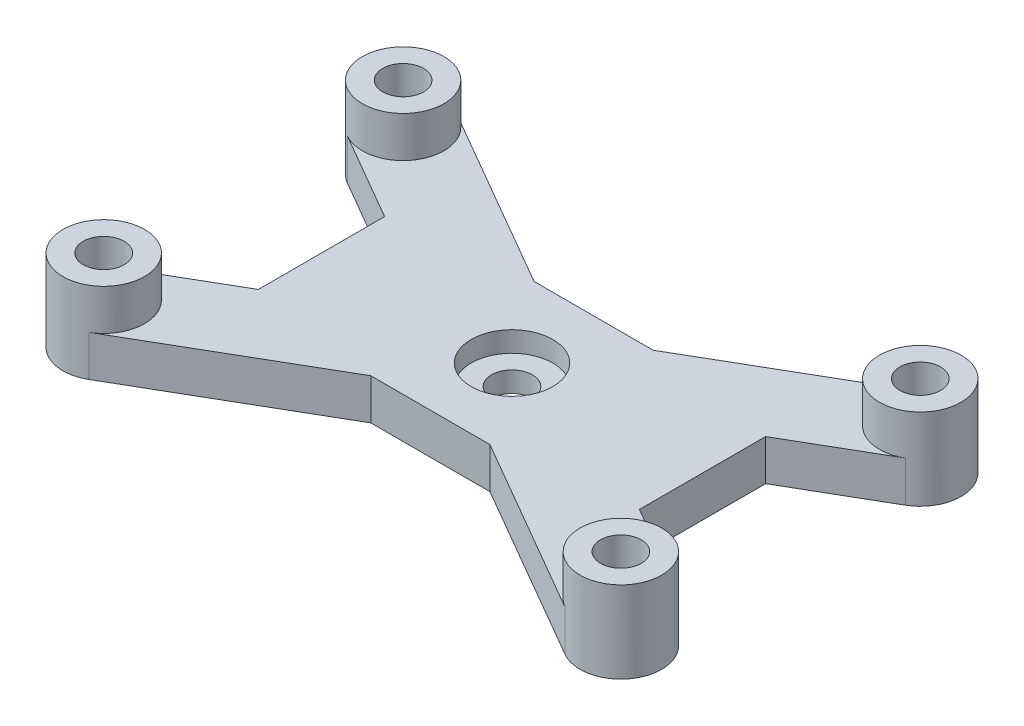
ISO-10303-21;
HEADER;
FILE_DESCRIPTION(('STEP AP214'),'2;1');
FILE_NAME('part.step','',(''),(''),'','','');
FILE_SCHEMA(('AUTOMOTIVE_DESIGN { 1 0 10303 214 1 1 1 1 }'));
ENDSEC;
DATA;
#1=APPLICATION_CONTEXT('core data for automotive mechanical design processes');
#2=APPLICATION_PROTOCOL_DEFINITION('international standard','automotive_design',2000,#1);
#3=PRODUCT_CONTEXT('',#1,'mechanical');
#4=PRODUCT('Part','Part','',(#3));
#5=PRODUCT_RELATED_PRODUCT_CATEGORY('part','',(#4));
#6=PRODUCT_DEFINITION_FORMATION('','',#4);
#7=PRODUCT_DEFINITION_CONTEXT('part definition',#1,'design');
#8=PRODUCT_DEFINITION('design','',#6,#7);
#9=PRODUCT_DEFINITION_SHAPE('','',#8);
#10=(LENGTH_UNIT() NAMED_UNIT(*) SI_UNIT(.MILLI.,.METRE.));
#11=(NAMED_UNIT(*) PLANE_ANGLE_UNIT() SI_UNIT($,.RADIAN.));
#12=(NAMED_UNIT(*) SI_UNIT($,.STERADIAN.) SOLID_ANGLE_UNIT());
#13=UNCERTAINTY_MEASURE_WITH_UNIT(LENGTH_MEASURE(1.E-05),#10,'distance_accuracy_value','');
#14=(GEOMETRIC_REPRESENTATION_CONTEXT(3) GLOBAL_UNCERTAINTY_ASSIGNED_CONTEXT((#13)) GLOBAL_UNIT_ASSIGNED_CONTEXT((#10,
#11,#12)) REPRESENTATION_CONTEXT('',''));
#15=CARTESIAN_POINT('',(0.,0.,0.));
#16=DIRECTION('',(0.,0.,1.));
#17=DIRECTION('',(1.,0.,0.));
#18=AXIS2_PLACEMENT_3D('',#15,#16,#17);
#19=CARTESIAN_POINT('',(-11.5680272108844,3.,-6.85034013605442));
#20=DIRECTION('',(0.,1.,0.));
#21=DIRECTION('',(0.,0.,1.));
#22=AXIS2_PLACEMENT_3D('',#19,#20,#21);
#23=PLANE('',#22);
#24=CARTESIAN_POINT('',(7.43197278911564,3.,4.14965986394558));
#25=DIRECTION('',(0.,1.,0.));
#26=DIRECTION('',(0.,0.,1.));
#27=AXIS2_PLACEMENT_3D('',#24,#25,#26);
#28=CIRCLE('',#27,3.);
#29=CARTESIAN_POINT('',(7.43197278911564,3.,7.14965986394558));
#30=VERTEX_POINT('',#29);
#31=EDGE_CURVE('E186',#30,#30,#28,.T.);
#32=ORIENTED_EDGE('',*,*,#31,.F.);
#33=EDGE_LOOP('',(#32));
#34=FACE_BOUND('',#33,.T.);
#35=DIRECTION('',(-0.865426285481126,0.,0.501036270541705));
#36=VECTOR('',#35,1.);
#37=CARTESIAN_POINT('',(-13.0711360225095,3.,12.5533810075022));
#38=LINE('',#37,#36);
#39=CARTESIAN_POINT('',(-6.56802721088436,3.,8.78842327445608));
#40=VERTEX_POINT('',#39);
#41=CARTESIAN_POINT('',(-13.0711360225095,3.,12.5533810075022));
#42=VERTEX_POINT('',#41);
#43=EDGE_CURVE('E211',#40,#42,#38,.T.);
#44=ORIENTED_EDGE('',*,*,#43,.T.);
#45=CARTESIAN_POINT('',(-11.5680272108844,3.,15.1496598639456));
#46=DIRECTION('',(0.,1.,0.));
#47=DIRECTION('',(0.,0.,1.));
#48=AXIS2_PLACEMENT_3D('',#45,#46,#47);
#49=CIRCLE('',#48,3.);
#50=CARTESIAN_POINT('',(-10.0649183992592,3.,17.745938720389));
#51=VERTEX_POINT('',#50);
#52=EDGE_CURVE('E325',#51,#42,#49,.T.);
#53=ORIENTED_EDGE('',*,*,#52,.F.);
#54=DIRECTION('',(0.865426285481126,0.,-0.501036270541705));
#55=VECTOR('',#54,1.);
#56=CARTESIAN_POINT('',(-10.0649183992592,3.,17.745938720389));
#57=LINE('',#56,#55);
#58=CARTESIAN_POINT('',(3.05592689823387,3.,10.1496598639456));
#59=VERTEX_POINT('',#58);
#60=EDGE_CURVE('E214',#51,#59,#57,.T.);
#61=ORIENTED_EDGE('',*,*,#60,.T.);
#62=DIRECTION('',(1.,0.,0.));
#63=VECTOR('',#62,1.);
#64=CARTESIAN_POINT('',(3.05592689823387,3.,10.1496598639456));
#65=LINE('',#64,#63);
#66=CARTESIAN_POINT('',(11.8080186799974,3.,10.1496598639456));
#67=VERTEX_POINT('',#66);
#68=EDGE_CURVE('E216',#59,#67,#65,.T.);
#69=ORIENTED_EDGE('',*,*,#68,.T.);
#70=DIRECTION('',(0.865426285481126,0.,0.501036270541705));
#71=VECTOR('',#70,1.);
#72=CARTESIAN_POINT('',(11.8080186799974,3.,10.1496598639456));
#73=LINE('',#72,#71);
#74=CARTESIAN_POINT('',(24.9288639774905,3.,17.745938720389));
#75=VERTEX_POINT('',#74);
#76=EDGE_CURVE('E218',#67,#75,#73,.T.);
#77=ORIENTED_EDGE('',*,*,#76,.T.);
#78=CARTESIAN_POINT('',(26.4319727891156,3.,15.1496598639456));
#79=DIRECTION('',(0.,1.,0.));
#80=DIRECTION('',(0.,0.,1.));
#81=AXIS2_PLACEMENT_3D('',#78,#79,#80);
#82=CIRCLE('',#81,3.);
#83=CARTESIAN_POINT('',(27.9350816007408,3.,12.5533810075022));
#84=VERTEX_POINT('',#83);
#85=EDGE_CURVE('E343',#84,#75,#82,.T.);
#86=ORIENTED_EDGE('',*,*,#85,.F.);
#87=DIRECTION('',(-0.865426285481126,0.,-0.501036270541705));
#88=VECTOR('',#87,1.);
#89=CARTESIAN_POINT('',(21.4319727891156,3.,8.78842327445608));
#90=LINE('',#89,#88);
#91=CARTESIAN_POINT('',(21.4319727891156,3.,8.78842327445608));
#92=VERTEX_POINT('',#91);
#93=EDGE_CURVE('E220',#84,#92,#90,.T.);
#94=ORIENTED_EDGE('',*,*,#93,.T.);
#95=DIRECTION('',(0.,0.,-1.));
#96=VECTOR('',#95,1.);
#97=CARTESIAN_POINT('',(21.4319727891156,3.,-0.489103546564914));
#98=LINE('',#97,#96);
#99=CARTESIAN_POINT('',(21.4319727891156,3.,-0.489103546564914));
#100=VERTEX_POINT('',#99);
#101=EDGE_CURVE('E151',#92,#100,#98,.T.);
#102=ORIENTED_EDGE('',*,*,#101,.T.);
#103=DIRECTION('',(0.865426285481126,0.,-0.501036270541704));
#104=VECTOR('',#103,1.);
#105=CARTESIAN_POINT('',(21.4319727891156,3.,-0.489103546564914));
#106=LINE('',#105,#104);
#107=CARTESIAN_POINT('',(27.9350816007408,3.,-4.25406127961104));
#108=VERTEX_POINT('',#107);
#109=EDGE_CURVE('E145',#100,#108,#106,.T.);
#110=ORIENTED_EDGE('',*,*,#109,.T.);
#111=CARTESIAN_POINT('',(26.4319727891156,3.,-6.85034013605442));
#112=DIRECTION('',(0.,1.,0.));
#113=DIRECTION('',(0.,0.,1.));
#114=AXIS2_PLACEMENT_3D('',#111,#112,#113);
#115=CIRCLE('',#114,3.);
#116=CARTESIAN_POINT('',(24.9288639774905,3.,-9.4466189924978));
#117=VERTEX_POINT('',#116);
#118=EDGE_CURVE('E149',#117,#108,#115,.T.);
#119=ORIENTED_EDGE('',*,*,#118,.F.);
#120=DIRECTION('',(-0.865426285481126,0.,0.501036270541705));
#121=VECTOR('',#120,1.);
#122=CARTESIAN_POINT('',(11.8080186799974,3.,-1.85034013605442));
#123=LINE('',#122,#121);
#124=CARTESIAN_POINT('',(11.8080186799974,3.,-1.85034013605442));
#125=VERTEX_POINT('',#124);
#126=EDGE_CURVE('E155',#117,#125,#123,.T.);
#127=ORIENTED_EDGE('',*,*,#126,.T.);
#128=DIRECTION('',(-1.,0.,0.));
#129=VECTOR('',#128,1.);
#130=CARTESIAN_POINT('',(3.05592689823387,3.,-1.85034013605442));
#131=LINE('',#130,#129);
#132=CARTESIAN_POINT('',(3.05592689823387,3.,-1.85034013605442));
#133=VERTEX_POINT('',#132);
#134=EDGE_CURVE('E51',#125,#133,#131,.T.);
#135=ORIENTED_EDGE('',*,*,#134,.T.);
#136=DIRECTION('',(-0.865426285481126,0.,-0.501036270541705));
#137=VECTOR('',#136,1.);
#138=CARTESIAN_POINT('',(-10.0649183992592,3.,-9.4466189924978));
#139=LINE('',#138,#137);
#140=CARTESIAN_POINT('',(-10.0649183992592,3.,-9.4466189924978));
#141=VERTEX_POINT('',#140);
#142=EDGE_CURVE('E225',#133,#141,#139,.T.);
#143=ORIENTED_EDGE('',*,*,#142,.T.);
#144=CARTESIAN_POINT('',(-11.5680272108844,3.,-6.85034013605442));
#145=DIRECTION('',(0.,1.,0.));
#146=DIRECTION('',(0.,0.,1.));
#147=AXIS2_PLACEMENT_3D('',#144,#145,#146);
#148=CIRCLE('',#147,3.);
#149=CARTESIAN_POINT('',(-13.0711360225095,3.,-4.25406127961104));
#150=VERTEX_POINT('',#149);
#151=EDGE_CURVE('E11',#150,#141,#148,.T.);
#152=ORIENTED_EDGE('',*,*,#151,.F.);
#153=DIRECTION('',(0.865426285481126,0.,0.501036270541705));
#154=VECTOR('',#153,1.);
#155=CARTESIAN_POINT('',(-13.0711360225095,3.,-4.25406127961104));
#156=LINE('',#155,#154);
#157=CARTESIAN_POINT('',(-6.56802721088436,3.,-0.489103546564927));
#158=VERTEX_POINT('',#157);
#159=EDGE_CURVE('E212',#150,#158,#156,.T.);
#160=ORIENTED_EDGE('',*,*,#159,.T.);
#161=DIRECTION('',(0.,0.,1.));
#162=VECTOR('',#161,1.);
#163=CARTESIAN_POINT('',(-6.56802721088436,3.,-0.489103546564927));
#164=LINE('',#163,#162);
#165=EDGE_CURVE('E209',#158,#40,#164,.T.);
#166=ORIENTED_EDGE('',*,*,#165,.T.);
#167=EDGE_LOOP('',(#44,#53,#61,#69,#77,#86,#94,#102,#110,#119,#127,#135,#143,#152,#160,#166));
#168=FACE_BOUND('',#167,.T.);
#169=ADVANCED_FACE('F32',(#34,#168),#23,.T.);
#170=CARTESIAN_POINT('',(7.43197278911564,3.,4.14965986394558));
#171=DIRECTION('',(0.,-1.,0.));
#172=DIRECTION('',(0.,0.,-1.));
#173=AXIS2_PLACEMENT_3D('',#170,#171,#172);
#174=CYLINDRICAL_SURFACE('',#173,1.5);
#175=CARTESIAN_POINT('',(7.43197278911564,0.,4.14965986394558));
#176=DIRECTION('',(0.,1.,0.));
#177=DIRECTION('',(0.,0.,1.));
#178=AXIS2_PLACEMENT_3D('',#175,#176,#177);
#179=CIRCLE('',#178,1.5);
#180=CARTESIAN_POINT('',(7.43197278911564,0.,5.64965986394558));
#181=VERTEX_POINT('',#180);
#182=EDGE_CURVE('E193',#181,#181,#179,.T.);
#183=ORIENTED_EDGE('',*,*,#182,.F.);
#184=EDGE_LOOP('',(#183));
#185=FACE_BOUND('',#184,.T.);
#186=CARTESIAN_POINT('',(7.43197278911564,1.5,4.14965986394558));
#187=DIRECTION('',(0.,1.,0.));
#188=DIRECTION('',(0.,0.,1.));
#189=AXIS2_PLACEMENT_3D('',#186,#187,#188);
#190=CIRCLE('',#189,1.5);
#191=CARTESIAN_POINT('',(7.43197278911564,1.5,5.64965986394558));
#192=VERTEX_POINT('',#191);
#193=EDGE_CURVE('E190',#192,#192,#190,.T.);
#194=ORIENTED_EDGE('',*,*,#193,.T.);
#195=EDGE_LOOP('',(#194));
#196=FACE_BOUND('',#195,.T.);
#197=ADVANCED_FACE('F377',(#185,#196),#174,.F.);
#198=CARTESIAN_POINT('',(-11.5680272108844,0.,-6.85034013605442));
#199=DIRECTION('',(0.,1.,0.));
#200=DIRECTION('',(0.,0.,1.));
#201=AXIS2_PLACEMENT_3D('',#198,#199,#200);
#202=PLANE('',#201);
#203=CARTESIAN_POINT('',(26.4319727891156,0.,15.1496598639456));
#204=DIRECTION('',(0.,1.,0.));
#205=DIRECTION('',(0.,0.,1.));
#206=AXIS2_PLACEMENT_3D('',#203,#204,#205);
#207=CIRCLE('',#206,1.5);
#208=CARTESIAN_POINT('',(26.4319727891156,0.,16.6496598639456));
#209=VERTEX_POINT('',#208);
#210=EDGE_CURVE('E196',#209,#209,#207,.T.);
#211=ORIENTED_EDGE('',*,*,#210,.T.);
#212=EDGE_LOOP('',(#211));
#213=FACE_BOUND('',#212,.T.);
#214=CARTESIAN_POINT('',(26.4319727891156,0.,-6.85034013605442));
#215=DIRECTION('',(0.,1.,0.));
#216=DIRECTION('',(0.,0.,1.));
#217=AXIS2_PLACEMENT_3D('',#214,#215,#216);
#218=CIRCLE('',#217,1.5);
#219=CARTESIAN_POINT('',(26.4319727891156,0.,-5.35034013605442));
#220=VERTEX_POINT('',#219);
#221=EDGE_CURVE('E202',#220,#220,#218,.T.);
#222=ORIENTED_EDGE('',*,*,#221,.T.);
#223=EDGE_LOOP('',(#222));
#224=FACE_BOUND('',#223,.T.);
#225=CARTESIAN_POINT('',(-11.5680272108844,0.,-6.85034013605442));
#226=DIRECTION('',(0.,1.,0.));
#227=DIRECTION('',(0.,0.,1.));
#228=AXIS2_PLACEMENT_3D('',#225,#226,#227);
#229=CIRCLE('',#228,3.);
#230=CARTESIAN_POINT('',(-10.0649183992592,0.,-9.4466189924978));
#231=VERTEX_POINT('',#230);
#232=CARTESIAN_POINT('',(-13.0711360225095,0.,-4.25406127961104));
#233=VERTEX_POINT('',#232);
#234=EDGE_CURVE('E208',#231,#233,#229,.T.);
#235=ORIENTED_EDGE('',*,*,#234,.F.);
#236=DIRECTION('',(-0.865426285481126,0.,-0.501036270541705));
#237=VECTOR('',#236,1.);
#238=CARTESIAN_POINT('',(-10.0649183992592,0.,-9.4466189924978));
#239=LINE('',#238,#237);
#240=CARTESIAN_POINT('',(3.05592689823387,0.,-1.85034013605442));
#241=VERTEX_POINT('',#240);
#242=EDGE_CURVE('E111',#241,#231,#239,.T.);
#243=ORIENTED_EDGE('',*,*,#242,.F.);
#244=DIRECTION('',(-1.,0.,0.));
#245=VECTOR('',#244,1.);
#246=CARTESIAN_POINT('',(3.05592689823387,0.,-1.85034013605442));
#247=LINE('',#246,#245);
#248=CARTESIAN_POINT('',(11.8080186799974,0.,-1.85034013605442));
#249=VERTEX_POINT('',#248);
#250=EDGE_CURVE('E104',#249,#241,#247,.T.);
#251=ORIENTED_EDGE('',*,*,#250,.F.);
#252=DIRECTION('',(-0.865426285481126,0.,0.501036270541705));
#253=VECTOR('',#252,1.);
#254=CARTESIAN_POINT('',(11.8080186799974,0.,-1.85034013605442));
#255=LINE('',#254,#253);
#256=CARTESIAN_POINT('',(24.9288639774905,0.,-9.4466189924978));
#257=VERTEX_POINT('',#256);
#258=EDGE_CURVE('E251',#257,#249,#255,.T.);
#259=ORIENTED_EDGE('',*,*,#258,.F.);
#260=CARTESIAN_POINT('',(26.4319727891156,0.,-6.85034013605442));
#261=DIRECTION('',(0.,1.,0.));
#262=DIRECTION('',(0.,0.,1.));
#263=AXIS2_PLACEMENT_3D('',#260,#261,#262);
#264=CIRCLE('',#263,3.);
#265=CARTESIAN_POINT('',(27.9350816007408,0.,-4.25406127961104));
#266=VERTEX_POINT('',#265);
#267=EDGE_CURVE('E249',#266,#257,#264,.T.);
#268=ORIENTED_EDGE('',*,*,#267,.F.);
#269=DIRECTION('',(0.865426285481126,0.,-0.501036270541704));
#270=VECTOR('',#269,1.);
#271=CARTESIAN_POINT('',(21.4319727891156,0.,-0.489103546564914));
#272=LINE('',#271,#270);
#273=CARTESIAN_POINT('',(21.4319727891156,0.,-0.489103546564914));
#274=VERTEX_POINT('',#273);
#275=EDGE_CURVE('E161',#274,#266,#272,.T.);
#276=ORIENTED_EDGE('',*,*,#275,.F.);
#277=DIRECTION('',(0.,0.,-1.));
#278=VECTOR('',#277,1.);
#279=CARTESIAN_POINT('',(21.4319727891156,0.,-0.489103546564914));
#280=LINE('',#279,#278);
#281=CARTESIAN_POINT('',(21.4319727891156,0.,8.78842327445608));
#282=VERTEX_POINT('',#281);
#283=EDGE_CURVE('E246',#282,#274,#280,.T.);
#284=ORIENTED_EDGE('',*,*,#283,.F.);
#285=DIRECTION('',(-0.865426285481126,0.,-0.501036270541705));
#286=VECTOR('',#285,1.);
#287=CARTESIAN_POINT('',(21.4319727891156,0.,8.78842327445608));
#288=LINE('',#287,#286);
#289=CARTESIAN_POINT('',(27.9350816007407,0.,12.5533810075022));
#290=VERTEX_POINT('',#289);
#291=EDGE_CURVE('E244',#290,#282,#288,.T.);
#292=ORIENTED_EDGE('',*,*,#291,.F.);
#293=CARTESIAN_POINT('',(26.4319727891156,0.,15.1496598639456));
#294=DIRECTION('',(0.,1.,0.));
#295=DIRECTION('',(0.,0.,1.));
#296=AXIS2_PLACEMENT_3D('',#293,#294,#295);
#297=CIRCLE('',#296,3.);
#298=CARTESIAN_POINT('',(24.9288639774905,0.,17.745938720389));
#299=VERTEX_POINT('',#298);
#300=EDGE_CURVE('E242',#299,#290,#297,.T.);
#301=ORIENTED_EDGE('',*,*,#300,.F.);
#302=DIRECTION('',(0.865426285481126,0.,0.501036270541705));
#303=VECTOR('',#302,1.);
#304=CARTESIAN_POINT('',(11.8080186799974,0.,10.1496598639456));
#305=LINE('',#304,#303);
#306=CARTESIAN_POINT('',(11.8080186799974,0.,10.1496598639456));
#307=VERTEX_POINT('',#306);
#308=EDGE_CURVE('E240',#307,#299,#305,.T.);
#309=ORIENTED_EDGE('',*,*,#308,.F.);
#310=DIRECTION('',(1.,0.,0.));
#311=VECTOR('',#310,1.);
#312=CARTESIAN_POINT('',(3.05592689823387,0.,10.1496598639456));
#313=LINE('',#312,#311);
#314=CARTESIAN_POINT('',(3.05592689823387,0.,10.1496598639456));
#315=VERTEX_POINT('',#314);
#316=EDGE_CURVE('E238',#315,#307,#313,.T.);
#317=ORIENTED_EDGE('',*,*,#316,.F.);
#318=DIRECTION('',(0.865426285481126,0.,-0.501036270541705));
#319=VECTOR('',#318,1.);
#320=CARTESIAN_POINT('',(-10.0649183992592,0.,17.745938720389));
#321=LINE('',#320,#319);
#322=CARTESIAN_POINT('',(-10.0649183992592,0.,17.745938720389));
#323=VERTEX_POINT('',#322);
#324=EDGE_CURVE('E236',#323,#315,#321,.T.);
#325=ORIENTED_EDGE('',*,*,#324,.F.);
#326=CARTESIAN_POINT('',(-11.5680272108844,0.,15.1496598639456));
#327=DIRECTION('',(0.,1.,0.));
#328=DIRECTION('',(0.,0.,1.));
#329=AXIS2_PLACEMENT_3D('',#326,#327,#328);
#330=CIRCLE('',#329,3.);
#331=CARTESIAN_POINT('',(-13.0711360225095,0.,12.5533810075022));
#332=VERTEX_POINT('',#331);
#333=EDGE_CURVE('E234',#332,#323,#330,.T.);
#334=ORIENTED_EDGE('',*,*,#333,.F.);
#335=DIRECTION('',(-0.865426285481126,0.,0.501036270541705));
#336=VECTOR('',#335,1.);
#337=CARTESIAN_POINT('',(-13.0711360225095,0.,12.5533810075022));
#338=LINE('',#337,#336);
#339=CARTESIAN_POINT('',(-6.56802721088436,0.,8.78842327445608));
#340=VERTEX_POINT('',#339);
#341=EDGE_CURVE('E232',#340,#332,#338,.T.);
#342=ORIENTED_EDGE('',*,*,#341,.F.);
#343=DIRECTION('',(0.,0.,1.));
#344=VECTOR('',#343,1.);
#345=CARTESIAN_POINT('',(-6.56802721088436,0.,-0.489103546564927));
#346=LINE('',#345,#344);
#347=CARTESIAN_POINT('',(-6.56802721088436,0.,-0.489103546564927));
#348=VERTEX_POINT('',#347);
#349=EDGE_CURVE('E230',#348,#340,#346,.T.);
#350=ORIENTED_EDGE('',*,*,#349,.F.);
#351=DIRECTION('',(0.865426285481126,0.,0.501036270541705));
#352=VECTOR('',#351,1.);
#353=CARTESIAN_POINT('',(-13.0711360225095,0.,-4.25406127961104));
#354=LINE('',#353,#352);
#355=EDGE_CURVE('E228',#233,#348,#354,.T.);
#356=ORIENTED_EDGE('',*,*,#355,.F.);
#357=EDGE_LOOP('',(#235,#243,#251,#259,#268,#276,#284,#292,#301,#309,#317,#325,#334,#342,#350,#356));
#358=FACE_BOUND('',#357,.T.);
#359=CARTESIAN_POINT('',(-11.5680272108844,0.,-6.85034013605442));
#360=DIRECTION('',(0.,1.,0.));
#361=DIRECTION('',(0.,0.,1.));
#362=AXIS2_PLACEMENT_3D('',#359,#360,#361);
#363=CIRCLE('',#362,1.5);
#364=CARTESIAN_POINT('',(-11.5680272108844,0.,-5.35034013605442));
#365=VERTEX_POINT('',#364);
#366=EDGE_CURVE('E205',#365,#365,#363,.T.);
#367=ORIENTED_EDGE('',*,*,#366,.T.);
#368=EDGE_LOOP('',(#367));
#369=FACE_BOUND('',#368,.T.);
#370=CARTESIAN_POINT('',(-11.5680272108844,0.,15.1496598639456));
#371=DIRECTION('',(0.,1.,0.));
#372=DIRECTION('',(0.,0.,1.));
#373=AXIS2_PLACEMENT_3D('',#370,#371,#372);
#374=CIRCLE('',#373,1.5);
#375=CARTESIAN_POINT('',(-11.5680272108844,0.,16.6496598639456));
#376=VERTEX_POINT('',#375);
#377=EDGE_CURVE('E199',#376,#376,#374,.T.);
#378=ORIENTED_EDGE('',*,*,#377,.T.);
#379=EDGE_LOOP('',(#378));
#380=FACE_BOUND('',#379,.T.);
#381=ORIENTED_EDGE('',*,*,#182,.T.);
#382=EDGE_LOOP('',(#381));
#383=FACE_BOUND('',#382,.T.);
#384=ADVANCED_FACE('F309',(#213,#224,#358,#369,#380,#383),#202,.F.);
#385=CARTESIAN_POINT('',(-11.5680272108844,3.,-6.85034013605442));
#386=DIRECTION('',(0.,-1.,0.));
#387=DIRECTION('',(0.,0.,-1.));
#388=AXIS2_PLACEMENT_3D('',#385,#386,#387);
#389=CYLINDRICAL_SURFACE('',#388,3.);
#390=ORIENTED_EDGE('',*,*,#234,.T.);
#391=DIRECTION('',(0.,-1.,0.));
#392=VECTOR('',#391,1.);
#393=CARTESIAN_POINT('',(-13.0711360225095,3.,-4.25406127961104));
#394=LINE('',#393,#392);
#395=EDGE_CURVE('E42',#150,#233,#394,.T.);
#396=ORIENTED_EDGE('',*,*,#395,.F.);
#397=ORIENTED_EDGE('',*,*,#151,.T.);
#398=DIRECTION('',(0.,-1.,0.));
#399=VECTOR('',#398,1.);
#400=CARTESIAN_POINT('',(-10.0649183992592,3.,-9.4466189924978));
#401=LINE('',#400,#399);
#402=EDGE_CURVE('E258',#141,#231,#401,.T.);
#403=ORIENTED_EDGE('',*,*,#402,.T.);
#404=EDGE_LOOP('',(#390,#396,#397,#403));
#405=FACE_BOUND('',#404,.T.);
#406=CARTESIAN_POINT('',(-11.5680272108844,6.,-6.85034013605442));
#407=DIRECTION('',(0.,1.,0.));
#408=DIRECTION('',(0.,0.,1.));
#409=AXIS2_PLACEMENT_3D('',#406,#407,#408);
#410=CIRCLE('',#409,3.);
#411=CARTESIAN_POINT('',(-11.5680272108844,6.,-3.85034013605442));
#412=VERTEX_POINT('',#411);
#413=EDGE_CURVE('E183',#412,#412,#410,.T.);
#414=ORIENTED_EDGE('',*,*,#413,.F.);
#415=EDGE_LOOP('',(#414));
#416=FACE_BOUND('',#415,.T.);
#417=ADVANCED_FACE('F34',(#405,#416),#389,.T.);
#418=CARTESIAN_POINT('',(-13.0711360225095,3.,-4.25406127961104));
#419=DIRECTION('',(0.501036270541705,0.,-0.865426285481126));
#420=DIRECTION('',(-0.865426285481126,0.,-0.501036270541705));
#421=AXIS2_PLACEMENT_3D('',#418,#419,#420);
#422=PLANE('',#421);
#423=ORIENTED_EDGE('',*,*,#355,.T.);
#424=DIRECTION('',(0.,-1.,0.));
#425=VECTOR('',#424,1.);
#426=CARTESIAN_POINT('',(-6.56802721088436,3.,-0.489103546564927));
#427=LINE('',#426,#425);
#428=EDGE_CURVE('E286',#158,#348,#427,.T.);
#429=ORIENTED_EDGE('',*,*,#428,.F.);
#430=ORIENTED_EDGE('',*,*,#159,.F.);
#431=ORIENTED_EDGE('',*,*,#395,.T.);
#432=EDGE_LOOP('',(#423,#429,#430,#431));
#433=FACE_BOUND('',#432,.T.);
#434=ADVANCED_FACE('F303',(#433),#422,.F.);
#435=CARTESIAN_POINT('',(-6.56802721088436,3.,-0.489103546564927));
#436=DIRECTION('',(1.,0.,0.));
#437=DIRECTION('',(0.,0.,-1.));
#438=AXIS2_PLACEMENT_3D('',#435,#436,#437);
#439=PLANE('',#438);
#440=ORIENTED_EDGE('',*,*,#349,.T.);
#441=DIRECTION('',(0.,-1.,0.));
#442=VECTOR('',#441,1.);
#443=CARTESIAN_POINT('',(-6.56802721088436,3.,8.78842327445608));
#444=LINE('',#443,#442);
#445=EDGE_CURVE('E283',#40,#340,#444,.T.);
#446=ORIENTED_EDGE('',*,*,#445,.F.);
#447=ORIENTED_EDGE('',*,*,#165,.F.);
#448=ORIENTED_EDGE('',*,*,#428,.T.);
#449=EDGE_LOOP('',(#440,#446,#447,#448));
#450=FACE_BOUND('',#449,.T.);
#451=ADVANCED_FACE('F316',(#450),#439,.F.);
#452=CARTESIAN_POINT('',(-13.0711360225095,3.,12.5533810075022));
#453=DIRECTION('',(0.501036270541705,0.,0.865426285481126));
#454=DIRECTION('',(0.865426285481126,0.,-0.501036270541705));
#455=AXIS2_PLACEMENT_3D('',#452,#453,#454);
#456=PLANE('',#455);
#457=ORIENTED_EDGE('',*,*,#341,.T.);
#458=DIRECTION('',(0.,-1.,0.));
#459=VECTOR('',#458,1.);
#460=CARTESIAN_POINT('',(-13.0711360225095,3.,12.5533810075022));
#461=LINE('',#460,#459);
#462=EDGE_CURVE('E280',#42,#332,#461,.T.);
#463=ORIENTED_EDGE('',*,*,#462,.F.);
#464=ORIENTED_EDGE('',*,*,#43,.F.);
#465=ORIENTED_EDGE('',*,*,#445,.T.);
#466=EDGE_LOOP('',(#457,#463,#464,#465));
#467=FACE_BOUND('',#466,.T.);
#468=ADVANCED_FACE('F320',(#467),#456,.F.);
#469=CARTESIAN_POINT('',(-11.5680272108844,3.,15.1496598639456));
#470=DIRECTION('',(0.,-1.,0.));
#471=DIRECTION('',(0.,0.,-1.));
#472=AXIS2_PLACEMENT_3D('',#469,#470,#471);
#473=CYLINDRICAL_SURFACE('',#472,3.);
#474=ORIENTED_EDGE('',*,*,#333,.T.);
#475=DIRECTION('',(0.,-1.,0.));
#476=VECTOR('',#475,1.);
#477=CARTESIAN_POINT('',(-10.0649183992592,3.,17.745938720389));
#478=LINE('',#477,#476);
#479=EDGE_CURVE('E277',#51,#323,#478,.T.);
#480=ORIENTED_EDGE('',*,*,#479,.F.);
#481=ORIENTED_EDGE('',*,*,#52,.T.);
#482=ORIENTED_EDGE('',*,*,#462,.T.);
#483=EDGE_LOOP('',(#474,#480,#481,#482));
#484=FACE_BOUND('',#483,.T.);
#485=CARTESIAN_POINT('',(-11.5680272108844,6.,15.1496598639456));
#486=DIRECTION('',(0.,1.,0.));
#487=DIRECTION('',(0.,0.,1.));
#488=AXIS2_PLACEMENT_3D('',#485,#486,#487);
#489=CIRCLE('',#488,3.);
#490=CARTESIAN_POINT('',(-11.5680272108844,6.,18.1496598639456));
#491=VERTEX_POINT('',#490);
#492=EDGE_CURVE('E332',#491,#491,#489,.T.);
#493=ORIENTED_EDGE('',*,*,#492,.F.);
#494=EDGE_LOOP('',(#493));
#495=FACE_BOUND('',#494,.T.);
#496=ADVANCED_FACE('F451',(#484,#495),#473,.T.);
#497=CARTESIAN_POINT('',(-10.0649183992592,3.,17.745938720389));
#498=DIRECTION('',(-0.501036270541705,0.,-0.865426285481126));
#499=DIRECTION('',(-0.865426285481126,0.,0.501036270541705));
#500=AXIS2_PLACEMENT_3D('',#497,#498,#499);
#501=PLANE('',#500);
#502=ORIENTED_EDGE('',*,*,#324,.T.);
#503=DIRECTION('',(0.,-1.,0.));
#504=VECTOR('',#503,1.);
#505=CARTESIAN_POINT('',(3.05592689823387,3.,10.1496598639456));
#506=LINE('',#505,#504);
#507=EDGE_CURVE('E274',#59,#315,#506,.T.);
#508=ORIENTED_EDGE('',*,*,#507,.F.);
#509=ORIENTED_EDGE('',*,*,#60,.F.);
#510=ORIENTED_EDGE('',*,*,#479,.T.);
#511=EDGE_LOOP('',(#502,#508,#509,#510));
#512=FACE_BOUND('',#511,.T.);
#513=ADVANCED_FACE('F453',(#512),#501,.F.);
#514=CARTESIAN_POINT('',(3.05592689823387,3.,10.1496598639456));
#515=DIRECTION('',(0.,0.,-1.));
#516=DIRECTION('',(-1.,0.,0.));
#517=AXIS2_PLACEMENT_3D('',#514,#515,#516);
#518=PLANE('',#517);
#519=ORIENTED_EDGE('',*,*,#316,.T.);
#520=DIRECTION('',(0.,-1.,0.));
#521=VECTOR('',#520,1.);
#522=CARTESIAN_POINT('',(11.8080186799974,3.,10.1496598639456));
#523=LINE('',#522,#521);
#524=EDGE_CURVE('E271',#67,#307,#523,.T.);
#525=ORIENTED_EDGE('',*,*,#524,.F.);
#526=ORIENTED_EDGE('',*,*,#68,.F.);
#527=ORIENTED_EDGE('',*,*,#507,.T.);
#528=EDGE_LOOP('',(#519,#525,#526,#527));
#529=FACE_BOUND('',#528,.T.);
#530=ADVANCED_FACE('F459',(#529),#518,.F.);
#531=CARTESIAN_POINT('',(11.8080186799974,3.,10.1496598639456));
#532=DIRECTION('',(0.501036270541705,0.,-0.865426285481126));
#533=DIRECTION('',(-0.865426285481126,0.,-0.501036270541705));
#534=AXIS2_PLACEMENT_3D('',#531,#532,#533);
#535=PLANE('',#534);
#536=ORIENTED_EDGE('',*,*,#308,.T.);
#537=DIRECTION('',(0.,-1.,0.));
#538=VECTOR('',#537,1.);
#539=CARTESIAN_POINT('',(24.9288639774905,3.,17.745938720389));
#540=LINE('',#539,#538);
#541=EDGE_CURVE('E268',#75,#299,#540,.T.);
#542=ORIENTED_EDGE('',*,*,#541,.F.);
#543=ORIENTED_EDGE('',*,*,#76,.F.);
#544=ORIENTED_EDGE('',*,*,#524,.T.);
#545=EDGE_LOOP('',(#536,#542,#543,#544));
#546=FACE_BOUND('',#545,.T.);
#547=ADVANCED_FACE('F530',(#546),#535,.F.);
#548=CARTESIAN_POINT('',(26.4319727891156,3.,15.1496598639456));
#549=DIRECTION('',(0.,-1.,0.));
#550=DIRECTION('',(0.,0.,-1.));
#551=AXIS2_PLACEMENT_3D('',#548,#549,#550);
#552=CYLINDRICAL_SURFACE('',#551,3.);
#553=ORIENTED_EDGE('',*,*,#300,.T.);
#554=DIRECTION('',(0.,-1.,0.));
#555=VECTOR('',#554,1.);
#556=CARTESIAN_POINT('',(27.9350816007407,3.,12.5533810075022));
#557=LINE('',#556,#555);
#558=EDGE_CURVE('E265',#84,#290,#557,.T.);
#559=ORIENTED_EDGE('',*,*,#558,.F.);
#560=ORIENTED_EDGE('',*,*,#85,.T.);
#561=ORIENTED_EDGE('',*,*,#541,.T.);
#562=EDGE_LOOP('',(#553,#559,#560,#561));
#563=FACE_BOUND('',#562,.T.);
#564=CARTESIAN_POINT('',(26.4319727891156,6.,15.1496598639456));
#565=DIRECTION('',(0.,1.,0.));
#566=DIRECTION('',(0.,0.,1.));
#567=AXIS2_PLACEMENT_3D('',#564,#565,#566);
#568=CIRCLE('',#567,3.);
#569=CARTESIAN_POINT('',(26.4319727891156,6.,18.1496598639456));
#570=VERTEX_POINT('',#569);
#571=EDGE_CURVE('E178',#570,#570,#568,.T.);
#572=ORIENTED_EDGE('',*,*,#571,.F.);
#573=EDGE_LOOP('',(#572));
#574=FACE_BOUND('',#573,.T.);
#575=ADVANCED_FACE('F350',(#563,#574),#552,.T.);
#576=CARTESIAN_POINT('',(21.4319727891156,3.,8.78842327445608));
#577=DIRECTION('',(-0.501036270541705,0.,0.865426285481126));
#578=DIRECTION('',(0.865426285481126,0.,0.501036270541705));
#579=AXIS2_PLACEMENT_3D('',#576,#577,#578);
#580=PLANE('',#579);
#581=ORIENTED_EDGE('',*,*,#291,.T.);
#582=DIRECTION('',(0.,-1.,0.));
#583=VECTOR('',#582,1.);
#584=CARTESIAN_POINT('',(21.4319727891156,3.,8.78842327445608));
#585=LINE('',#584,#583);
#586=EDGE_CURVE('E262',#92,#282,#585,.T.);
#587=ORIENTED_EDGE('',*,*,#586,.F.);
#588=ORIENTED_EDGE('',*,*,#93,.F.);
#589=ORIENTED_EDGE('',*,*,#558,.T.);
#590=EDGE_LOOP('',(#581,#587,#588,#589));
#591=FACE_BOUND('',#590,.T.);
#592=ADVANCED_FACE('F529',(#591),#580,.F.);
#593=CARTESIAN_POINT('',(21.4319727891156,3.,-0.489103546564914));
#594=DIRECTION('',(-1.,0.,0.));
#595=DIRECTION('',(0.,0.,1.));
#596=AXIS2_PLACEMENT_3D('',#593,#594,#595);
#597=PLANE('',#596);
#598=ORIENTED_EDGE('',*,*,#283,.T.);
#599=DIRECTION('',(0.,-1.,0.));
#600=VECTOR('',#599,1.);
#601=CARTESIAN_POINT('',(21.4319727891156,3.,-0.489103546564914));
#602=LINE('',#601,#600);
#603=EDGE_CURVE('E164',#100,#274,#602,.T.);
#604=ORIENTED_EDGE('',*,*,#603,.F.);
#605=ORIENTED_EDGE('',*,*,#101,.F.);
#606=ORIENTED_EDGE('',*,*,#586,.T.);
#607=EDGE_LOOP('',(#598,#604,#605,#606));
#608=FACE_BOUND('',#607,.T.);
#609=ADVANCED_FACE('F608',(#608),#597,.F.);
#610=CARTESIAN_POINT('',(21.4319727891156,3.,-0.489103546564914));
#611=DIRECTION('',(-0.501036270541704,0.,-0.865426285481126));
#612=DIRECTION('',(-0.865426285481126,0.,0.501036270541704));
#613=AXIS2_PLACEMENT_3D('',#610,#611,#612);
#614=PLANE('',#613);
#615=ORIENTED_EDGE('',*,*,#275,.T.);
#616=DIRECTION('',(0.,-1.,0.));
#617=VECTOR('',#616,1.);
#618=CARTESIAN_POINT('',(27.9350816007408,3.,-4.25406127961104));
#619=LINE('',#618,#617);
#620=EDGE_CURVE('E158',#108,#266,#619,.T.);
#621=ORIENTED_EDGE('',*,*,#620,.F.);
#622=ORIENTED_EDGE('',*,*,#109,.F.);
#623=ORIENTED_EDGE('',*,*,#603,.T.);
#624=EDGE_LOOP('',(#615,#621,#622,#623));
#625=FACE_BOUND('',#624,.T.);
#626=ADVANCED_FACE('F159',(#625),#614,.F.);
#627=CARTESIAN_POINT('',(26.4319727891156,3.,-6.85034013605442));
#628=DIRECTION('',(0.,-1.,0.));
#629=DIRECTION('',(0.,0.,-1.));
#630=AXIS2_PLACEMENT_3D('',#627,#628,#629);
#631=CYLINDRICAL_SURFACE('',#630,3.);
#632=ORIENTED_EDGE('',*,*,#267,.T.);
#633=DIRECTION('',(0.,-1.,0.));
#634=VECTOR('',#633,1.);
#635=CARTESIAN_POINT('',(24.9288639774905,3.,-9.4466189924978));
#636=LINE('',#635,#634);
#637=EDGE_CURVE('E165',#117,#257,#636,.T.);
#638=ORIENTED_EDGE('',*,*,#637,.F.);
#639=ORIENTED_EDGE('',*,*,#118,.T.);
#640=ORIENTED_EDGE('',*,*,#620,.T.);
#641=EDGE_LOOP('',(#632,#638,#639,#640));
#642=FACE_BOUND('',#641,.T.);
#643=CARTESIAN_POINT('',(26.4319727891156,6.,-6.85034013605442));
#644=DIRECTION('',(0.,1.,0.));
#645=DIRECTION('',(0.,0.,1.));
#646=AXIS2_PLACEMENT_3D('',#643,#644,#645);
#647=CIRCLE('',#646,3.);
#648=CARTESIAN_POINT('',(26.4319727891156,6.,-3.85034013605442));
#649=VERTEX_POINT('',#648);
#650=EDGE_CURVE('E171',#649,#649,#647,.T.);
#651=ORIENTED_EDGE('',*,*,#650,.F.);
#652=EDGE_LOOP('',(#651));
#653=FACE_BOUND('',#652,.T.);
#654=ADVANCED_FACE('F168',(#642,#653),#631,.T.);
#655=CARTESIAN_POINT('',(11.8080186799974,3.,-1.85034013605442));
#656=DIRECTION('',(0.501036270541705,0.,0.865426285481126));
#657=DIRECTION('',(0.865426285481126,0.,-0.501036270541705));
#658=AXIS2_PLACEMENT_3D('',#655,#656,#657);
#659=PLANE('',#658);
#660=ORIENTED_EDGE('',*,*,#258,.T.);
#661=DIRECTION('',(0.,-1.,0.));
#662=VECTOR('',#661,1.);
#663=CARTESIAN_POINT('',(11.8080186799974,3.,-1.85034013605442));
#664=LINE('',#663,#662);
#665=EDGE_CURVE('E257',#125,#249,#664,.T.);
#666=ORIENTED_EDGE('',*,*,#665,.F.);
#667=ORIENTED_EDGE('',*,*,#126,.F.);
#668=ORIENTED_EDGE('',*,*,#637,.T.);
#669=EDGE_LOOP('',(#660,#666,#667,#668));
#670=FACE_BOUND('',#669,.T.);
#671=ADVANCED_FACE('F367',(#670),#659,.F.);
#672=CARTESIAN_POINT('',(3.05592689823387,3.,-1.85034013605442));
#673=DIRECTION('',(0.,0.,1.));
#674=DIRECTION('',(1.,0.,0.));
#675=AXIS2_PLACEMENT_3D('',#672,#673,#674);
#676=PLANE('',#675);
#677=ORIENTED_EDGE('',*,*,#250,.T.);
#678=DIRECTION('',(0.,-1.,0.));
#679=VECTOR('',#678,1.);
#680=CARTESIAN_POINT('',(3.05592689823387,3.,-1.85034013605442));
#681=LINE('',#680,#679);
#682=EDGE_CURVE('E255',#133,#241,#681,.T.);
#683=ORIENTED_EDGE('',*,*,#682,.F.);
#684=ORIENTED_EDGE('',*,*,#134,.F.);
#685=ORIENTED_EDGE('',*,*,#665,.T.);
#686=EDGE_LOOP('',(#677,#683,#684,#685));
#687=FACE_BOUND('',#686,.T.);
#688=ADVANCED_FACE('F365',(#687),#676,.F.);
#689=CARTESIAN_POINT('',(-10.0649183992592,3.,-9.4466189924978));
#690=DIRECTION('',(-0.501036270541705,0.,0.865426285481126));
#691=DIRECTION('',(0.865426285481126,0.,0.501036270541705));
#692=AXIS2_PLACEMENT_3D('',#689,#690,#691);
#693=PLANE('',#692);
#694=ORIENTED_EDGE('',*,*,#242,.T.);
#695=ORIENTED_EDGE('',*,*,#402,.F.);
#696=ORIENTED_EDGE('',*,*,#142,.F.);
#697=ORIENTED_EDGE('',*,*,#682,.T.);
#698=EDGE_LOOP('',(#694,#695,#696,#697));
#699=FACE_BOUND('',#698,.T.);
#700=ADVANCED_FACE('F363',(#699),#693,.F.);
#701=CARTESIAN_POINT('',(-11.5680272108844,3.,-6.85034013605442));
#702=DIRECTION('',(0.,-1.,0.));
#703=DIRECTION('',(0.,0.,-1.));
#704=AXIS2_PLACEMENT_3D('',#701,#702,#703);
#705=CYLINDRICAL_SURFACE('',#704,1.5);
#706=ORIENTED_EDGE('',*,*,#366,.F.);
#707=EDGE_LOOP('',(#706));
#708=FACE_BOUND('',#707,.T.);
#709=CARTESIAN_POINT('',(-11.5680272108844,6.,-6.85034013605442));
#710=DIRECTION('',(0.,1.,0.));
#711=DIRECTION('',(0.,0.,1.));
#712=AXIS2_PLACEMENT_3D('',#709,#710,#711);
#713=CIRCLE('',#712,1.5);
#714=CARTESIAN_POINT('',(-11.5680272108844,6.,-5.35034013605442));
#715=VERTEX_POINT('',#714);
#716=EDGE_CURVE('E175',#715,#715,#713,.T.);
#717=ORIENTED_EDGE('',*,*,#716,.T.);
#718=EDGE_LOOP('',(#717));
#719=FACE_BOUND('',#718,.T.);
#720=ADVANCED_FACE('F388',(#708,#719),#705,.F.);
#721=CARTESIAN_POINT('',(26.4319727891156,3.,-6.85034013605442));
#722=DIRECTION('',(0.,-1.,0.));
#723=DIRECTION('',(0.,0.,-1.));
#724=AXIS2_PLACEMENT_3D('',#721,#722,#723);
#725=CYLINDRICAL_SURFACE('',#724,1.5);
#726=ORIENTED_EDGE('',*,*,#221,.F.);
#727=EDGE_LOOP('',(#726));
#728=FACE_BOUND('',#727,.T.);
#729=CARTESIAN_POINT('',(26.4319727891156,6.,-6.85034013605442));
#730=DIRECTION('',(0.,1.,0.));
#731=DIRECTION('',(0.,0.,1.));
#732=AXIS2_PLACEMENT_3D('',#729,#730,#731);
#733=CIRCLE('',#732,1.5);
#734=CARTESIAN_POINT('',(26.4319727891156,6.,-5.35034013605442));
#735=VERTEX_POINT('',#734);
#736=EDGE_CURVE('E172',#735,#735,#733,.T.);
#737=ORIENTED_EDGE('',*,*,#736,.T.);
#738=EDGE_LOOP('',(#737));
#739=FACE_BOUND('',#738,.T.);
#740=ADVANCED_FACE('F397',(#728,#739),#725,.F.);
#741=CARTESIAN_POINT('',(-11.5680272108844,3.,15.1496598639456));
#742=DIRECTION('',(0.,-1.,0.));
#743=DIRECTION('',(0.,0.,-1.));
#744=AXIS2_PLACEMENT_3D('',#741,#742,#743);
#745=CYLINDRICAL_SURFACE('',#744,1.5);
#746=ORIENTED_EDGE('',*,*,#377,.F.);
#747=EDGE_LOOP('',(#746));
#748=FACE_BOUND('',#747,.T.);
#749=CARTESIAN_POINT('',(-11.5680272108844,6.,15.1496598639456));
#750=DIRECTION('',(0.,1.,0.));
#751=DIRECTION('',(0.,0.,1.));
#752=AXIS2_PLACEMENT_3D('',#749,#750,#751);
#753=CIRCLE('',#752,1.5);
#754=CARTESIAN_POINT('',(-11.5680272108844,6.,16.6496598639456));
#755=VERTEX_POINT('',#754);
#756=EDGE_CURVE('E333',#755,#755,#753,.T.);
#757=ORIENTED_EDGE('',*,*,#756,.T.);
#758=EDGE_LOOP('',(#757));
#759=FACE_BOUND('',#758,.T.);
#760=ADVANCED_FACE('F402',(#748,#759),#745,.F.);
#761=CARTESIAN_POINT('',(26.4319727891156,3.,15.1496598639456));
#762=DIRECTION('',(0.,-1.,0.));
#763=DIRECTION('',(0.,0.,-1.));
#764=AXIS2_PLACEMENT_3D('',#761,#762,#763);
#765=CYLINDRICAL_SURFACE('',#764,1.5);
#766=ORIENTED_EDGE('',*,*,#210,.F.);
#767=EDGE_LOOP('',(#766));
#768=FACE_BOUND('',#767,.T.);
#769=CARTESIAN_POINT('',(26.4319727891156,6.,15.1496598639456));
#770=DIRECTION('',(0.,1.,0.));
#771=DIRECTION('',(0.,0.,1.));
#772=AXIS2_PLACEMENT_3D('',#769,#770,#771);
#773=CIRCLE('',#772,1.5);
#774=CARTESIAN_POINT('',(26.4319727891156,6.,16.6496598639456));
#775=VERTEX_POINT('',#774);
#776=EDGE_CURVE('E336',#775,#775,#773,.T.);
#777=ORIENTED_EDGE('',*,*,#776,.T.);
#778=EDGE_LOOP('',(#777));
#779=FACE_BOUND('',#778,.T.);
#780=ADVANCED_FACE('F427',(#768,#779),#765,.F.);
#781=CARTESIAN_POINT('',(7.43197278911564,1.5,4.14965986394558));
#782=DIRECTION('',(0.,1.,0.));
#783=DIRECTION('',(0.,0.,1.));
#784=AXIS2_PLACEMENT_3D('',#781,#782,#783);
#785=CYLINDRICAL_SURFACE('',#784,3.);
#786=CARTESIAN_POINT('',(7.43197278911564,1.5,4.14965986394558));
#787=DIRECTION('',(0.,1.,0.));
#788=DIRECTION('',(0.,0.,1.));
#789=AXIS2_PLACEMENT_3D('',#786,#787,#788);
#790=CIRCLE('',#789,3.);
#791=CARTESIAN_POINT('',(7.43197278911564,1.5,7.14965986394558));
#792=VERTEX_POINT('',#791);
#793=EDGE_CURVE('E187',#792,#792,#790,.T.);
#794=ORIENTED_EDGE('',*,*,#793,.F.);
#795=EDGE_LOOP('',(#794));
#796=FACE_BOUND('',#795,.T.);
#797=ORIENTED_EDGE('',*,*,#31,.T.);
#798=EDGE_LOOP('',(#797));
#799=FACE_BOUND('',#798,.T.);
#800=ADVANCED_FACE('F421',(#796,#799),#785,.F.);
#801=CARTESIAN_POINT('',(7.43197278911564,1.5,4.14965986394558));
#802=DIRECTION('',(0.,1.,0.));
#803=DIRECTION('',(0.,0.,1.));
#804=AXIS2_PLACEMENT_3D('',#801,#802,#803);
#805=PLANE('',#804);
#806=ORIENTED_EDGE('',*,*,#193,.F.);
#807=EDGE_LOOP('',(#806));
#808=FACE_BOUND('',#807,.T.);
#809=ORIENTED_EDGE('',*,*,#793,.T.);
#810=EDGE_LOOP('',(#809));
#811=FACE_BOUND('',#810,.T.);
#812=ADVANCED_FACE('F411',(#808,#811),#805,.T.);
#813=CARTESIAN_POINT('',(-11.5680272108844,6.,-6.85034013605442));
#814=DIRECTION('',(0.,1.,0.));
#815=DIRECTION('',(0.,0.,1.));
#816=AXIS2_PLACEMENT_3D('',#813,#814,#815);
#817=PLANE('',#816);
#818=ORIENTED_EDGE('',*,*,#413,.T.);
#819=EDGE_LOOP('',(#818));
#820=FACE_BOUND('',#819,.T.);
#821=ORIENTED_EDGE('',*,*,#716,.F.);
#822=EDGE_LOOP('',(#821));
#823=FACE_BOUND('',#822,.T.);
#824=ADVANCED_FACE('F408',(#820,#823),#817,.T.);
#825=CARTESIAN_POINT('',(26.4319727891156,6.,-6.85034013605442));
#826=DIRECTION('',(0.,1.,0.));
#827=DIRECTION('',(0.,0.,1.));
#828=AXIS2_PLACEMENT_3D('',#825,#826,#827);
#829=PLANE('',#828);
#830=ORIENTED_EDGE('',*,*,#650,.T.);
#831=EDGE_LOOP('',(#830));
#832=FACE_BOUND('',#831,.T.);
#833=ORIENTED_EDGE('',*,*,#736,.F.);
#834=EDGE_LOOP('',(#833));
#835=FACE_BOUND('',#834,.T.);
#836=ADVANCED_FACE('F410',(#832,#835),#829,.T.);
#837=CARTESIAN_POINT('',(26.4319727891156,6.,15.1496598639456));
#838=DIRECTION('',(0.,1.,0.));
#839=DIRECTION('',(0.,0.,1.));
#840=AXIS2_PLACEMENT_3D('',#837,#838,#839);
#841=PLANE('',#840);
#842=ORIENTED_EDGE('',*,*,#571,.T.);
#843=EDGE_LOOP('',(#842));
#844=FACE_BOUND('',#843,.T.);
#845=ORIENTED_EDGE('',*,*,#776,.F.);
#846=EDGE_LOOP('',(#845));
#847=FACE_BOUND('',#846,.T.);
#848=ADVANCED_FACE('F418',(#844,#847),#841,.T.);
#849=CARTESIAN_POINT('',(-11.5680272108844,6.,15.1496598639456));
#850=DIRECTION('',(0.,1.,0.));
#851=DIRECTION('',(0.,0.,1.));
#852=AXIS2_PLACEMENT_3D('',#849,#850,#851);
#853=PLANE('',#852);
#854=ORIENTED_EDGE('',*,*,#492,.T.);
#855=EDGE_LOOP('',(#854));
#856=FACE_BOUND('',#855,.T.);
#857=ORIENTED_EDGE('',*,*,#756,.F.);
#858=EDGE_LOOP('',(#857));
#859=FACE_BOUND('',#858,.T.);
#860=ADVANCED_FACE('F441',(#856,#859),#853,.T.);
#861=CLOSED_SHELL('',(#169,#197,#384,#417,#434,#451,#468,#496,#513,#530,#547,#575,#592,#609,
#626,#654,#671,#688,#700,#720,#740,#760,#780,#800,#812,#824,#836,#848,#860));
#862=MANIFOLD_SOLID_BREP('B2',#861);
#863=ADVANCED_BREP_SHAPE_REPRESENTATION('',(#18,#862),#14);
#864=SHAPE_DEFINITION_REPRESENTATION(#9,#863);
ENDSEC;
END-ISO-10303-21;
